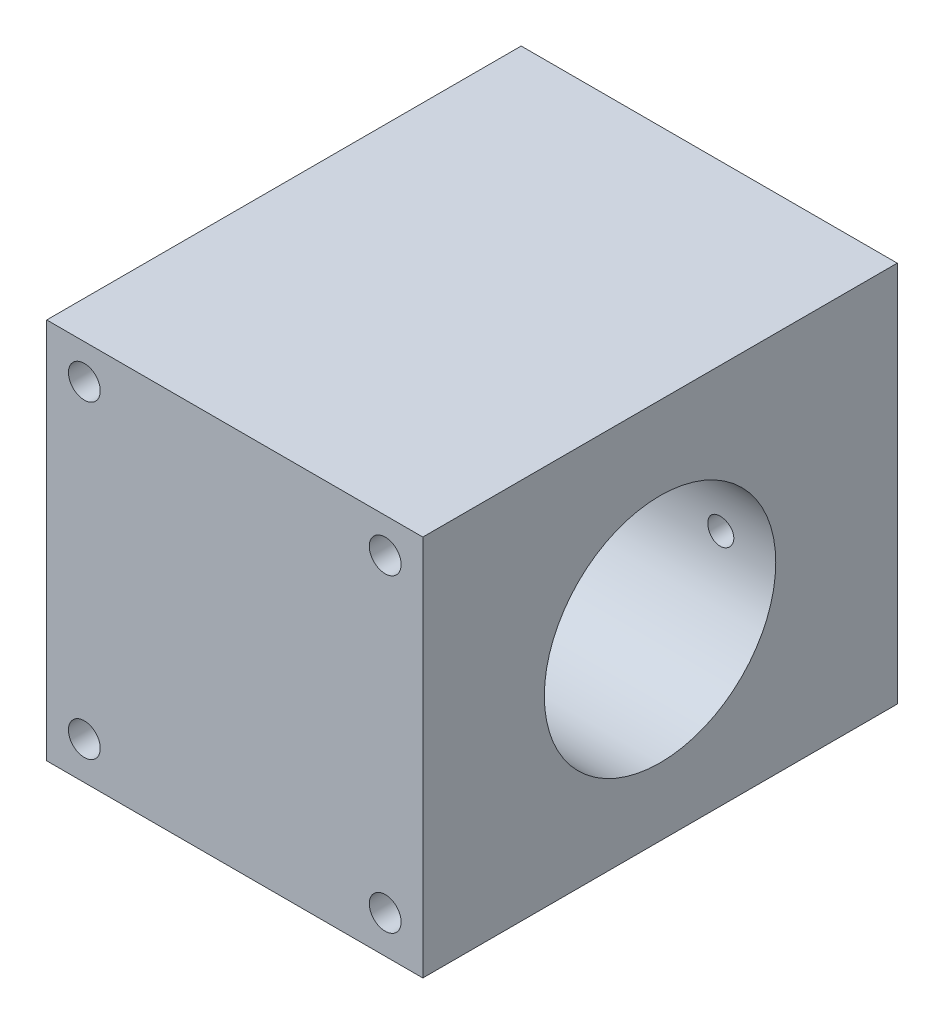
from build123d import *

# Parameters (mm, degrees)
SKETCH_1_W                = 65
SKETCH_1_H                = 66
EXTRUDE_1_DEPTH           = 82
HOLE_WIZARD_1_D           = 5.5
HOLE_WIZARD_1_CBORE_D     = 9.6
HOLE_WIZARD_1_CBORE_DEPTH = 50
HOLE_WIZARD_2_D           = 4.5
HOLE_WIZARD_2_DEPTH       = 40
HOLE_WIZARD_2_CBORE_D     = 8
HOLE_WIZARD_2_CBORE_DEPTH = 5
HOLE_WIZARD_2_TIP         = 1.351936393
CUT_EXTRUDE_13_DEPTH      = 0.2
SKETCH_29_R               = 20
CUT_EXTRUDE_14_DEPTH      = 124.713378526


with BuildPart() as part:
    # Sketch 1 → Extrude 1 (new body)
    with BuildSketch(Plane.XY):
        with Locations((32.5, 33)):
            Rectangle(SKETCH_1_W, SKETCH_1_H)
    extrude(amount=EXTRUDE_1_DEPTH)

    # Hole Wizard 1 (through all)
    with Locations(Plane(origin=(0, 0, 0), x_dir=(-1, 0, 0), z_dir=(0, 0, -1))):
        with Locations((-58.5, 6.5), (-6.5, 6.5), (-58.5, 60), (-6.5, 60)):
            CounterBoreHole(HOLE_WIZARD_1_D / 2, HOLE_WIZARD_1_CBORE_D / 2, HOLE_WIZARD_1_CBORE_DEPTH)

    # Hole Wizard 2
    with Locations(Plane(origin=(0, 0, 0), x_dir=(-1, 0, 0), z_dir=(0, 0, -1))):
        with Locations((-55.5, 31.7), (-9.5, 31.7)):
            CounterBoreHole(HOLE_WIZARD_2_D / 2, HOLE_WIZARD_2_CBORE_D / 2, HOLE_WIZARD_2_CBORE_DEPTH, depth=HOLE_WIZARD_2_DEPTH)
            with Locations((0, 0, -(HOLE_WIZARD_2_DEPTH + HOLE_WIZARD_2_TIP / 2))):  # 118° drill point
                Cone(0, HOLE_WIZARD_2_D / 2, HOLE_WIZARD_2_TIP, mode=Mode.SUBTRACT)

    # Sketch 28 → Cut-Extrude 13 (cut)
    with BuildSketch(Plane(origin=(0, 0, 0), x_dir=(-1, 0, 0), z_dir=(0, 0, -1))):
        with BuildLine():
            Line((-40.97454653, 44.627387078), (-38.89906887, 40.691279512))
            Line((-38.89906887, 40.691279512), (-44.238306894, 40.691279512))
            Line((-44.238306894, 40.691279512), (-45.699982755, 43.793504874))
            Line((-45.699982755, 43.793504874), (-46.848385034, 46.230963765))
            add(Edge.make_bspline(
                [(-46.848385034, 46.230963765), (-45.840587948, 46.230963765), (-42.525020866, 46.019621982), (-42.559152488, 47.269692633)],
                knots=[0.230769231, 0.230769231, 0.230769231, 0.230769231, 0.307692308, 0.307692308, 0.307692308, 0.307692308], degree=3))
            add(Edge.make_bspline(
                [(-42.559152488, 47.269692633), (-42.574694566, 47.840635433), (-43.402462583, 48.126106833), (-45.042532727, 48.126106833)],
                knots=[0.307692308, 0.307692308, 0.307692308, 0.307692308, 0.384615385, 0.384615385, 0.384615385, 0.384615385], degree=3))
            Line((-45.042532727, 48.126106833), (-46.9194677, 48.126106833))
            add(Edge.make_bspline(
                [(-46.9194677, 48.126106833), (-47.660763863, 45.65217374), (-48.374937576, 43.169326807), (-49.103815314, 40.691279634)],
                knots=[0.461538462, 0.461538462, 0.461538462, 0.461538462, 0.538461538, 0.538461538, 0.538461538, 0.538461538], degree=3))
            Line((-49.103815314, 40.691279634), (-54.242606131, 40.691279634))
            Line((-54.242606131, 40.691279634), (-51.492419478, 50.09416058))
            Line((-51.492419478, 50.09416058), (-43.620204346, 50.09416058))
            add(Edge.make_bspline(
                [(-43.620204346, 50.09416058), (-41.482102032, 50.09416058), (-39.893076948, 49.851201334), (-38.853357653, 49.365282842)],
                knots=[0.769230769, 0.769230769, 0.769230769, 0.769230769, 0.846153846, 0.846153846, 0.846153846, 0.846153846], degree=3))
            add(Edge.make_bspline(
                [(-38.853357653, 49.365282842), (-37.813562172, 48.87936435), (-37.282160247, 48.217226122), (-37.25930425, 47.379020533)],
                knots=[0.846153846, 0.846153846, 0.846153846, 0.846153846, 0.923076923, 0.923076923, 0.923076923, 0.923076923], degree=3))
            add(Edge.make_bspline(
                [(-37.25930425, 47.379020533), (-37.222506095, 46.030516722), (-38.460920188, 45.11330557), (-40.97454653, 44.627387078)],
                knots=[0.923076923, 0.923076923, 0.923076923, 0.923076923, 1, 1, 1, 1], degree=3))
        make_face()
        Polygon((-20.499230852, 53.437002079), (-22.48449512, 51.358432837), (-22.459668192, 51.28076823), (-19.601294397, 51.28076823), (-17.544254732, 53.437002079), align=None)
        Polygon((-20.027939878, 54.71914723), (-21.505503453, 54.71914723), (-22.534023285, 53.640954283), (-21.05645971, 53.640954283), align=None)
        Polygon((-23.174601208, 53.220632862), (-24.912571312, 53.220632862), (-26.122492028, 51.952353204), (-24.384444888, 51.952353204), align=None)
        Polygon((-31.083004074, 46.676351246), (-28.915723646, 43.974619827), (-29.866836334, 40.691279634), (-35.133163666, 40.691279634), (-34.030741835, 44.567580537), (-38.232512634, 50.09416058), (-33.824657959, 50.09416058), align=None)
        Polygon((-16.164971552, 43.361241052), (-12.689869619, 45.751064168), (-9.57734012, 40.6730711), (-14.861951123, 40.6730711), align=None)
        Polygon((-26.69031133, 51.28076823), (-22.558673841, 51.28076823), (-28.779730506, 44.444005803), (-30.804542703, 46.968221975), align=None)
        with BuildLine():
            Line((-20.097117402, 41.534132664), (-20.346933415, 40.6730711))
            Line((-20.346933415, 40.6730711), (-25.321770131, 40.6730711))
            Line((-25.321770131, 40.6730711), (-22.590249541, 50.09416058))
            Line((-22.590249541, 50.09416058), (-17.597204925, 50.09416058))
            Line((-17.597204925, 50.09416058), (-18.864341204, 45.77544383))
            Line((-18.864341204, 45.77544383), (-12.197856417, 50.094160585))
            Line((-12.197856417, 50.094160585), (-7.246790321, 50.094160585))
            add(Edge.make_bspline(
                [(-7.246790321, 50.094160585), (-11.60977155, 47.460159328), (-15.843464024, 44.040978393), (-20.097117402, 41.534132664)],
                knots=[0.875, 0.875, 0.875, 0.875, 1, 1, 1, 1], degree=3))
        make_face()
    extrude(amount=-CUT_EXTRUDE_13_DEPTH, mode=Mode.SUBTRACT)

    # Sketch 29 → Cut-Extrude 14 (cut, through all)
    with BuildSketch(Plane(origin=(65, 0, 0), x_dir=(0, 0, -1), z_dir=(1, 0, 0))):
        with Locations((-41, 31.7)):
            Circle(SKETCH_29_R)
    extrude(amount=-CUT_EXTRUDE_14_DEPTH, mode=Mode.SUBTRACT)


solid = part.part
